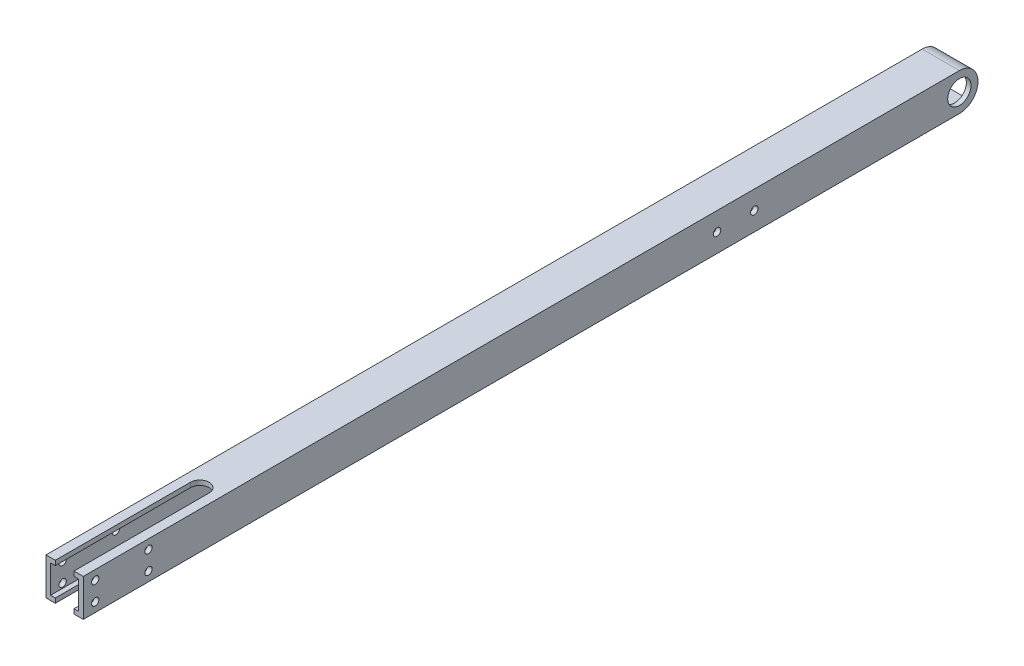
ISO-10303-21;
HEADER;
FILE_DESCRIPTION(('STEP AP214'),'2;1');
FILE_NAME('part.step','',(''),(''),'','','');
FILE_SCHEMA(('AUTOMOTIVE_DESIGN { 1 0 10303 214 1 1 1 1 }'));
ENDSEC;
DATA;
#1=APPLICATION_CONTEXT('core data for automotive mechanical design processes');
#2=APPLICATION_PROTOCOL_DEFINITION('international standard','automotive_design',2000,#1);
#3=PRODUCT_CONTEXT('',#1,'mechanical');
#4=PRODUCT('Part','Part','',(#3));
#5=PRODUCT_RELATED_PRODUCT_CATEGORY('part','',(#4));
#6=PRODUCT_DEFINITION_FORMATION('','',#4);
#7=PRODUCT_DEFINITION_CONTEXT('part definition',#1,'design');
#8=PRODUCT_DEFINITION('design','',#6,#7);
#9=PRODUCT_DEFINITION_SHAPE('','',#8);
#10=(LENGTH_UNIT() NAMED_UNIT(*) SI_UNIT(.MILLI.,.METRE.));
#11=(NAMED_UNIT(*) PLANE_ANGLE_UNIT() SI_UNIT($,.RADIAN.));
#12=(NAMED_UNIT(*) SI_UNIT($,.STERADIAN.) SOLID_ANGLE_UNIT());
#13=UNCERTAINTY_MEASURE_WITH_UNIT(LENGTH_MEASURE(1.E-05),#10,'distance_accuracy_value','');
#14=(GEOMETRIC_REPRESENTATION_CONTEXT(3) GLOBAL_UNCERTAINTY_ASSIGNED_CONTEXT((#13)) GLOBAL_UNIT_ASSIGNED_CONTEXT((#10,
#11,#12)) REPRESENTATION_CONTEXT('',''));
#15=CARTESIAN_POINT('',(0.,0.,0.));
#16=DIRECTION('',(0.,0.,1.));
#17=DIRECTION('',(1.,0.,0.));
#18=AXIS2_PLACEMENT_3D('',#15,#16,#17);
#19=CARTESIAN_POINT('',(0.,0.,609.6));
#20=DIRECTION('',(0.,0.,-1.));
#21=DIRECTION('',(-1.,0.,0.));
#22=AXIS2_PLACEMENT_3D('',#19,#20,#21);
#23=PLANE('',#22);
#24=DIRECTION('',(0.,-1.,0.));
#25=VECTOR('',#24,1.);
#26=CARTESIAN_POINT('',(6.34999999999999,-9.525,609.6));
#27=LINE('',#26,#25);
#28=CARTESIAN_POINT('',(6.34999999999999,-9.525,609.6));
#29=VERTEX_POINT('',#28);
#30=CARTESIAN_POINT('',(6.34999999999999,-12.7,609.6));
#31=VERTEX_POINT('',#30);
#32=EDGE_CURVE('E196',#29,#31,#27,.T.);
#33=ORIENTED_EDGE('',*,*,#32,.T.);
#34=DIRECTION('',(1.,0.,0.));
#35=VECTOR('',#34,1.);
#36=CARTESIAN_POINT('',(-12.7,-12.7,609.6));
#37=LINE('',#36,#35);
#38=CARTESIAN_POINT('',(12.7,-12.7,609.6));
#39=VERTEX_POINT('',#38);
#40=EDGE_CURVE('E251',#31,#39,#37,.T.);
#41=ORIENTED_EDGE('',*,*,#40,.T.);
#42=DIRECTION('',(0.,1.,0.));
#43=VECTOR('',#42,1.);
#44=CARTESIAN_POINT('',(12.7,-12.7,609.6));
#45=LINE('',#44,#43);
#46=CARTESIAN_POINT('',(12.7,12.7,609.6));
#47=VERTEX_POINT('',#46);
#48=EDGE_CURVE('E242',#39,#47,#45,.T.);
#49=ORIENTED_EDGE('',*,*,#48,.T.);
#50=DIRECTION('',(-1.,0.,0.));
#51=VECTOR('',#50,1.);
#52=CARTESIAN_POINT('',(-12.7,12.7,609.6));
#53=LINE('',#52,#51);
#54=CARTESIAN_POINT('',(6.35,12.7,609.6));
#55=VERTEX_POINT('',#54);
#56=EDGE_CURVE('E246',#47,#55,#53,.T.);
#57=ORIENTED_EDGE('',*,*,#56,.T.);
#58=DIRECTION('',(0.,1.,0.));
#59=VECTOR('',#58,1.);
#60=CARTESIAN_POINT('',(6.35,-12.701,609.6));
#61=LINE('',#60,#59);
#62=CARTESIAN_POINT('',(6.35,9.52499999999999,609.6));
#63=VERTEX_POINT('',#62);
#64=EDGE_CURVE('E381',#63,#55,#61,.T.);
#65=ORIENTED_EDGE('',*,*,#64,.F.);
#66=DIRECTION('',(-1.,0.,0.));
#67=VECTOR('',#66,1.);
#68=CARTESIAN_POINT('',(-9.525,9.525,609.6));
#69=LINE('',#68,#67);
#70=CARTESIAN_POINT('',(9.525,9.525,609.6));
#71=VERTEX_POINT('',#70);
#72=EDGE_CURVE('E228',#71,#63,#69,.T.);
#73=ORIENTED_EDGE('',*,*,#72,.F.);
#74=DIRECTION('',(0.,1.,0.));
#75=VECTOR('',#74,1.);
#76=CARTESIAN_POINT('',(9.525,-9.525,609.6));
#77=LINE('',#76,#75);
#78=CARTESIAN_POINT('',(9.525,-9.525,609.6));
#79=VERTEX_POINT('',#78);
#80=EDGE_CURVE('E217',#79,#71,#77,.T.);
#81=ORIENTED_EDGE('',*,*,#80,.F.);
#82=DIRECTION('',(1.,0.,0.));
#83=VECTOR('',#82,1.);
#84=CARTESIAN_POINT('',(-9.525,-9.525,609.6));
#85=LINE('',#84,#83);
#86=EDGE_CURVE('E210',#29,#79,#85,.T.);
#87=ORIENTED_EDGE('',*,*,#86,.F.);
#88=EDGE_LOOP('',(#33,#41,#49,#57,#65,#73,#81,#87));
#89=FACE_BOUND('',#88,.T.);
#90=ADVANCED_FACE('F77',(#89),#23,.F.);
#91=CARTESIAN_POINT('',(-12.7,-12.7,609.6));
#92=DIRECTION('',(0.,1.,0.));
#93=DIRECTION('',(0.,0.,1.));
#94=AXIS2_PLACEMENT_3D('',#91,#92,#93);
#95=PLANE('',#94);
#96=DIRECTION('',(0.,0.,-1.));
#97=VECTOR('',#96,1.);
#98=CARTESIAN_POINT('',(6.35000000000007,-12.7,0.));
#99=LINE('',#98,#97);
#100=CARTESIAN_POINT('',(6.35,-12.7,527.05));
#101=VERTEX_POINT('',#100);
#102=EDGE_CURVE('E201',#31,#101,#99,.T.);
#103=ORIENTED_EDGE('',*,*,#102,.T.);
#104=CARTESIAN_POINT('',(0.,-12.7,527.05));
#105=DIRECTION('',(0.,1.,0.));
#106=DIRECTION('',(0.,0.,1.));
#107=AXIS2_PLACEMENT_3D('',#104,#105,#106);
#108=CIRCLE('',#107,6.35);
#109=CARTESIAN_POINT('',(0.,-12.7,520.7));
#110=VERTEX_POINT('',#109);
#111=EDGE_CURVE('E86',#101,#110,#108,.T.);
#112=ORIENTED_EDGE('',*,*,#111,.T.);
#113=CARTESIAN_POINT('',(0.,-12.7,527.05));
#114=DIRECTION('',(0.,1.,0.));
#115=DIRECTION('',(0.,0.,1.));
#116=AXIS2_PLACEMENT_3D('',#113,#114,#115);
#117=CIRCLE('',#116,6.35);
#118=CARTESIAN_POINT('',(-6.35,-12.7,527.05));
#119=VERTEX_POINT('',#118);
#120=EDGE_CURVE('E311',#110,#119,#117,.T.);
#121=ORIENTED_EDGE('',*,*,#120,.T.);
#122=DIRECTION('',(0.,0.,-1.));
#123=VECTOR('',#122,1.);
#124=CARTESIAN_POINT('',(-6.34999999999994,-12.7,0.));
#125=LINE('',#124,#123);
#126=CARTESIAN_POINT('',(-6.35000000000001,-12.7,609.6));
#127=VERTEX_POINT('',#126);
#128=EDGE_CURVE('E212',#127,#119,#125,.T.);
#129=ORIENTED_EDGE('',*,*,#128,.F.);
#130=CARTESIAN_POINT('',(-12.7,-12.7,609.6));
#131=VERTEX_POINT('',#130);
#132=EDGE_CURVE('E252',#131,#127,#37,.T.);
#133=ORIENTED_EDGE('',*,*,#132,.F.);
#134=DIRECTION('',(0.,0.,-1.));
#135=VECTOR('',#134,1.);
#136=CARTESIAN_POINT('',(-12.7,-12.7,609.6));
#137=LINE('',#136,#135);
#138=CARTESIAN_POINT('',(-12.7,-12.7,12.7000000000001));
#139=VERTEX_POINT('',#138);
#140=EDGE_CURVE('E258',#131,#139,#137,.T.);
#141=ORIENTED_EDGE('',*,*,#140,.T.);
#142=DIRECTION('',(1.,0.,0.));
#143=VECTOR('',#142,1.);
#144=CARTESIAN_POINT('',(-12.7,-12.7,12.7000000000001));
#145=LINE('',#144,#143);
#146=CARTESIAN_POINT('',(12.7,-12.7,12.7000000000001));
#147=VERTEX_POINT('',#146);
#148=EDGE_CURVE('E407',#139,#147,#145,.T.);
#149=ORIENTED_EDGE('',*,*,#148,.T.);
#150=DIRECTION('',(0.,0.,-1.));
#151=VECTOR('',#150,1.);
#152=CARTESIAN_POINT('',(12.7,-12.7,609.6));
#153=LINE('',#152,#151);
#154=EDGE_CURVE('E255',#39,#147,#153,.T.);
#155=ORIENTED_EDGE('',*,*,#154,.F.);
#156=ORIENTED_EDGE('',*,*,#40,.F.);
#157=EDGE_LOOP('',(#103,#112,#121,#129,#133,#141,#149,#155,#156));
#158=FACE_BOUND('',#157,.T.);
#159=ADVANCED_FACE('F317',(#158),#95,.F.);
#160=CARTESIAN_POINT('',(-9.525,-9.525,609.6));
#161=DIRECTION('',(0.,1.,0.));
#162=DIRECTION('',(0.,0.,1.));
#163=AXIS2_PLACEMENT_3D('',#160,#161,#162);
#164=PLANE('',#163);
#165=CARTESIAN_POINT('',(0.,-9.525,527.05));
#166=DIRECTION('',(0.,1.,0.));
#167=DIRECTION('',(0.,0.,1.));
#168=AXIS2_PLACEMENT_3D('',#165,#166,#167);
#169=CIRCLE('',#168,6.35);
#170=CARTESIAN_POINT('',(-6.35,-9.525,527.05));
#171=VERTEX_POINT('',#170);
#172=CARTESIAN_POINT('',(0.,-9.525,520.7));
#173=VERTEX_POINT('',#172);
#174=EDGE_CURVE('E92',#171,#173,#169,.F.);
#175=ORIENTED_EDGE('',*,*,#174,.T.);
#176=CARTESIAN_POINT('',(0.,-9.525,527.05));
#177=DIRECTION('',(0.,1.,0.));
#178=DIRECTION('',(0.,0.,1.));
#179=AXIS2_PLACEMENT_3D('',#176,#177,#178);
#180=CIRCLE('',#179,6.35);
#181=CARTESIAN_POINT('',(6.35,-9.525,527.05));
#182=VERTEX_POINT('',#181);
#183=EDGE_CURVE('E12',#173,#182,#180,.F.);
#184=ORIENTED_EDGE('',*,*,#183,.T.);
#185=DIRECTION('',(0.,0.,-1.));
#186=VECTOR('',#185,1.);
#187=CARTESIAN_POINT('',(6.35000000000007,-9.525,0.));
#188=LINE('',#187,#186);
#189=EDGE_CURVE('E199',#29,#182,#188,.T.);
#190=ORIENTED_EDGE('',*,*,#189,.F.);
#191=ORIENTED_EDGE('',*,*,#86,.T.);
#192=DIRECTION('',(0.,0.,-1.));
#193=VECTOR('',#192,1.);
#194=CARTESIAN_POINT('',(9.525,-9.525,609.6));
#195=LINE('',#194,#193);
#196=CARTESIAN_POINT('',(9.525,-9.52499999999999,4.29973958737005));
#197=VERTEX_POINT('',#196);
#198=EDGE_CURVE('E237',#79,#197,#195,.T.);
#199=ORIENTED_EDGE('',*,*,#198,.T.);
#200=DIRECTION('',(1.,0.,0.));
#201=VECTOR('',#200,1.);
#202=CARTESIAN_POINT('',(-12.7,-9.52499999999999,4.29973958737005));
#203=LINE('',#202,#201);
#204=CARTESIAN_POINT('',(-9.525,-9.52499999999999,4.29973958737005));
#205=VERTEX_POINT('',#204);
#206=EDGE_CURVE('E411',#205,#197,#203,.T.);
#207=ORIENTED_EDGE('',*,*,#206,.F.);
#208=DIRECTION('',(0.,0.,-1.));
#209=VECTOR('',#208,1.);
#210=CARTESIAN_POINT('',(-9.525,-9.525,609.6));
#211=LINE('',#210,#209);
#212=CARTESIAN_POINT('',(-9.525,-9.525,609.6));
#213=VERTEX_POINT('',#212);
#214=EDGE_CURVE('E239',#213,#205,#211,.T.);
#215=ORIENTED_EDGE('',*,*,#214,.F.);
#216=CARTESIAN_POINT('',(-6.35000000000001,-9.525,609.6));
#217=VERTEX_POINT('',#216);
#218=EDGE_CURVE('E218',#213,#217,#85,.T.);
#219=ORIENTED_EDGE('',*,*,#218,.T.);
#220=DIRECTION('',(0.,0.,-1.));
#221=VECTOR('',#220,1.);
#222=CARTESIAN_POINT('',(-6.34999999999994,-9.525,0.));
#223=LINE('',#222,#221);
#224=EDGE_CURVE('E206',#217,#171,#223,.T.);
#225=ORIENTED_EDGE('',*,*,#224,.T.);
#226=EDGE_LOOP('',(#175,#184,#190,#191,#199,#207,#215,#219,#225));
#227=FACE_BOUND('',#226,.T.);
#228=ADVANCED_FACE('F208',(#227),#164,.T.);
#229=ORIENTED_EDGE('',*,*,#132,.T.);
#230=DIRECTION('',(0.,-1.,0.));
#231=VECTOR('',#230,1.);
#232=CARTESIAN_POINT('',(-6.35000000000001,-9.525,609.6));
#233=LINE('',#232,#231);
#234=EDGE_CURVE('E205',#217,#127,#233,.T.);
#235=ORIENTED_EDGE('',*,*,#234,.F.);
#236=ORIENTED_EDGE('',*,*,#218,.F.);
#237=DIRECTION('',(0.,-1.,0.));
#238=VECTOR('',#237,1.);
#239=CARTESIAN_POINT('',(-9.525,-9.525,609.6));
#240=LINE('',#239,#238);
#241=CARTESIAN_POINT('',(-9.525,9.525,609.6));
#242=VERTEX_POINT('',#241);
#243=EDGE_CURVE('E219',#242,#213,#240,.T.);
#244=ORIENTED_EDGE('',*,*,#243,.F.);
#245=CARTESIAN_POINT('',(-6.34999999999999,9.52499999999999,609.6));
#246=VERTEX_POINT('',#245);
#247=EDGE_CURVE('E227',#246,#242,#69,.T.);
#248=ORIENTED_EDGE('',*,*,#247,.F.);
#249=DIRECTION('',(0.,1.,0.));
#250=VECTOR('',#249,1.);
#251=CARTESIAN_POINT('',(-6.34999999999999,-12.701,609.6));
#252=LINE('',#251,#250);
#253=CARTESIAN_POINT('',(-6.34999999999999,12.7,609.6));
#254=VERTEX_POINT('',#253);
#255=EDGE_CURVE('E382',#246,#254,#252,.T.);
#256=ORIENTED_EDGE('',*,*,#255,.T.);
#257=CARTESIAN_POINT('',(-12.7,12.7,609.6));
#258=VERTEX_POINT('',#257);
#259=EDGE_CURVE('E245',#254,#258,#53,.T.);
#260=ORIENTED_EDGE('',*,*,#259,.T.);
#261=DIRECTION('',(0.,-1.,0.));
#262=VECTOR('',#261,1.);
#263=CARTESIAN_POINT('',(-12.7,-12.7,609.6));
#264=LINE('',#263,#262);
#265=EDGE_CURVE('E249',#258,#131,#264,.T.);
#266=ORIENTED_EDGE('',*,*,#265,.T.);
#267=EDGE_LOOP('',(#229,#235,#236,#244,#248,#256,#260,#266));
#268=FACE_BOUND('',#267,.T.);
#269=ADVANCED_FACE('F447',(#268),#23,.F.);
#270=CARTESIAN_POINT('',(-12.7,12.7,609.6));
#271=DIRECTION('',(0.,-1.,0.));
#272=DIRECTION('',(0.,0.,-1.));
#273=AXIS2_PLACEMENT_3D('',#270,#271,#272);
#274=PLANE('',#273);
#275=DIRECTION('',(0.,0.,-1.));
#276=VECTOR('',#275,1.);
#277=CARTESIAN_POINT('',(-6.35000000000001,12.7,0.));
#278=LINE('',#277,#276);
#279=CARTESIAN_POINT('',(-6.35,12.7,517.525));
#280=VERTEX_POINT('',#279);
#281=EDGE_CURVE('E378',#254,#280,#278,.T.);
#282=ORIENTED_EDGE('',*,*,#281,.T.);
#283=CARTESIAN_POINT('',(0.,12.7,517.525));
#284=DIRECTION('',(0.,1.,0.));
#285=DIRECTION('',(0.,0.,1.));
#286=AXIS2_PLACEMENT_3D('',#283,#284,#285);
#287=CIRCLE('',#286,6.35);
#288=CARTESIAN_POINT('',(6.35,12.7,517.525));
#289=VERTEX_POINT('',#288);
#290=EDGE_CURVE('E383',#280,#289,#287,.F.);
#291=ORIENTED_EDGE('',*,*,#290,.T.);
#292=DIRECTION('',(0.,0.,-1.));
#293=VECTOR('',#292,1.);
#294=CARTESIAN_POINT('',(6.35,12.7,0.));
#295=LINE('',#294,#293);
#296=EDGE_CURVE('E377',#55,#289,#295,.T.);
#297=ORIENTED_EDGE('',*,*,#296,.F.);
#298=ORIENTED_EDGE('',*,*,#56,.F.);
#299=DIRECTION('',(0.,0.,-1.));
#300=VECTOR('',#299,1.);
#301=CARTESIAN_POINT('',(12.7,12.7,609.6));
#302=LINE('',#301,#300);
#303=CARTESIAN_POINT('',(12.7,12.7,12.7000000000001));
#304=VERTEX_POINT('',#303);
#305=EDGE_CURVE('E264',#47,#304,#302,.T.);
#306=ORIENTED_EDGE('',*,*,#305,.T.);
#307=DIRECTION('',(1.,0.,0.));
#308=VECTOR('',#307,1.);
#309=CARTESIAN_POINT('',(-12.7,12.7,12.7000000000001));
#310=LINE('',#309,#308);
#311=CARTESIAN_POINT('',(-12.7,12.7,12.7000000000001));
#312=VERTEX_POINT('',#311);
#313=EDGE_CURVE('E400',#312,#304,#310,.T.);
#314=ORIENTED_EDGE('',*,*,#313,.F.);
#315=DIRECTION('',(0.,0.,-1.));
#316=VECTOR('',#315,1.);
#317=CARTESIAN_POINT('',(-12.7,12.7,609.6));
#318=LINE('',#317,#316);
#319=EDGE_CURVE('E261',#258,#312,#318,.T.);
#320=ORIENTED_EDGE('',*,*,#319,.F.);
#321=ORIENTED_EDGE('',*,*,#259,.F.);
#322=EDGE_LOOP('',(#282,#291,#297,#298,#306,#314,#320,#321));
#323=FACE_BOUND('',#322,.T.);
#324=ADVANCED_FACE('F457',(#323),#274,.F.);
#325=CARTESIAN_POINT('',(-9.525,9.525,609.6));
#326=DIRECTION('',(0.,-1.,0.));
#327=DIRECTION('',(0.,0.,-1.));
#328=AXIS2_PLACEMENT_3D('',#325,#326,#327);
#329=PLANE('',#328);
#330=CARTESIAN_POINT('',(0.,9.525,517.525));
#331=DIRECTION('',(0.,-1.,0.));
#332=DIRECTION('',(0.,0.,-1.));
#333=AXIS2_PLACEMENT_3D('',#330,#331,#332);
#334=CIRCLE('',#333,6.35);
#335=CARTESIAN_POINT('',(-6.35,9.52499999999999,517.525));
#336=VERTEX_POINT('',#335);
#337=CARTESIAN_POINT('',(6.35,9.525,517.525));
#338=VERTEX_POINT('',#337);
#339=EDGE_CURVE('E375',#336,#338,#334,.T.);
#340=ORIENTED_EDGE('',*,*,#339,.F.);
#341=DIRECTION('',(0.,0.,-1.));
#342=VECTOR('',#341,1.);
#343=CARTESIAN_POINT('',(-6.35000000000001,9.525,0.));
#344=LINE('',#343,#342);
#345=EDGE_CURVE('E374',#246,#336,#344,.T.);
#346=ORIENTED_EDGE('',*,*,#345,.F.);
#347=ORIENTED_EDGE('',*,*,#247,.T.);
#348=DIRECTION('',(0.,0.,-1.));
#349=VECTOR('',#348,1.);
#350=CARTESIAN_POINT('',(-9.525,9.525,609.6));
#351=LINE('',#350,#349);
#352=CARTESIAN_POINT('',(-9.525,9.525,4.29973958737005));
#353=VERTEX_POINT('',#352);
#354=EDGE_CURVE('E231',#242,#353,#351,.T.);
#355=ORIENTED_EDGE('',*,*,#354,.T.);
#356=DIRECTION('',(1.,0.,0.));
#357=VECTOR('',#356,1.);
#358=CARTESIAN_POINT('',(-12.7,9.525,4.29973958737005));
#359=LINE('',#358,#357);
#360=CARTESIAN_POINT('',(9.525,9.525,4.29973958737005));
#361=VERTEX_POINT('',#360);
#362=EDGE_CURVE('E273',#361,#353,#359,.F.);
#363=ORIENTED_EDGE('',*,*,#362,.F.);
#364=DIRECTION('',(0.,0.,-1.));
#365=VECTOR('',#364,1.);
#366=CARTESIAN_POINT('',(9.525,9.525,609.6));
#367=LINE('',#366,#365);
#368=EDGE_CURVE('E234',#71,#361,#367,.T.);
#369=ORIENTED_EDGE('',*,*,#368,.F.);
#370=ORIENTED_EDGE('',*,*,#72,.T.);
#371=DIRECTION('',(0.,0.,-1.));
#372=VECTOR('',#371,1.);
#373=CARTESIAN_POINT('',(6.35,9.525,0.));
#374=LINE('',#373,#372);
#375=EDGE_CURVE('E389',#63,#338,#374,.T.);
#376=ORIENTED_EDGE('',*,*,#375,.T.);
#377=EDGE_LOOP('',(#340,#346,#347,#355,#363,#369,#370,#376));
#378=FACE_BOUND('',#377,.T.);
#379=ADVANCED_FACE('F443',(#378),#329,.T.);
#380=CARTESIAN_POINT('',(12.7,-12.7,609.6));
#381=DIRECTION('',(-1.,0.,0.));
#382=DIRECTION('',(0.,0.,1.));
#383=AXIS2_PLACEMENT_3D('',#380,#381,#382);
#384=PLANE('',#383);
#385=CARTESIAN_POINT('',(12.7,-6.34999999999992,601.435714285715));
#386=DIRECTION('',(-1.,0.,0.));
#387=DIRECTION('',(0.,0.,1.));
#388=AXIS2_PLACEMENT_3D('',#385,#386,#387);
#389=CIRCLE('',#388,2.48919999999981);
#390=CARTESIAN_POINT('',(12.7,-6.34999999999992,603.924914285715));
#391=VERTEX_POINT('',#390);
#392=EDGE_CURVE('E306',#391,#391,#389,.T.);
#393=ORIENTED_EDGE('',*,*,#392,.T.);
#394=EDGE_LOOP('',(#393));
#395=FACE_BOUND('',#394,.T.);
#396=CARTESIAN_POINT('',(12.7,6.35000000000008,601.435714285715));
#397=DIRECTION('',(-1.,0.,0.));
#398=DIRECTION('',(0.,0.,1.));
#399=AXIS2_PLACEMENT_3D('',#396,#397,#398);
#400=CIRCLE('',#399,2.48919999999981);
#401=CARTESIAN_POINT('',(12.7,6.35000000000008,603.924914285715));
#402=VERTEX_POINT('',#401);
#403=EDGE_CURVE('E301',#402,#402,#400,.T.);
#404=ORIENTED_EDGE('',*,*,#403,.T.);
#405=EDGE_LOOP('',(#404));
#406=FACE_BOUND('',#405,.T.);
#407=CARTESIAN_POINT('',(12.7,-6.34999999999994,565.15));
#408=DIRECTION('',(-1.,0.,0.));
#409=DIRECTION('',(0.,0.,1.));
#410=AXIS2_PLACEMENT_3D('',#407,#408,#409);
#411=CIRCLE('',#410,2.48919999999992);
#412=CARTESIAN_POINT('',(12.7,-6.34999999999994,567.6392));
#413=VERTEX_POINT('',#412);
#414=EDGE_CURVE('E296',#413,#413,#411,.T.);
#415=ORIENTED_EDGE('',*,*,#414,.T.);
#416=EDGE_LOOP('',(#415));
#417=FACE_BOUND('',#416,.T.);
#418=CARTESIAN_POINT('',(12.7,6.35000000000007,565.15));
#419=DIRECTION('',(-1.,0.,0.));
#420=DIRECTION('',(0.,0.,1.));
#421=AXIS2_PLACEMENT_3D('',#418,#419,#420);
#422=CIRCLE('',#421,2.48919999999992);
#423=CARTESIAN_POINT('',(12.7,6.35000000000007,567.6392));
#424=VERTEX_POINT('',#423);
#425=EDGE_CURVE('E291',#424,#424,#422,.T.);
#426=ORIENTED_EDGE('',*,*,#425,.T.);
#427=EDGE_LOOP('',(#426));
#428=FACE_BOUND('',#427,.T.);
#429=CARTESIAN_POINT('',(12.7,0.,152.4));
#430=DIRECTION('',(1.,0.,0.));
#431=DIRECTION('',(0.,0.,-1.));
#432=AXIS2_PLACEMENT_3D('',#429,#430,#431);
#433=CIRCLE('',#432,2.55270000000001);
#434=CARTESIAN_POINT('',(12.7,0.,149.8473));
#435=VERTEX_POINT('',#434);
#436=EDGE_CURVE('E360',#435,#435,#433,.T.);
#437=ORIENTED_EDGE('',*,*,#436,.F.);
#438=EDGE_LOOP('',(#437));
#439=FACE_BOUND('',#438,.T.);
#440=CARTESIAN_POINT('',(12.7,0.,177.8));
#441=DIRECTION('',(1.,0.,0.));
#442=DIRECTION('',(0.,0.,-1.));
#443=AXIS2_PLACEMENT_3D('',#440,#441,#442);
#444=CIRCLE('',#443,2.55269999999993);
#445=CARTESIAN_POINT('',(12.7,0.,175.2473));
#446=VERTEX_POINT('',#445);
#447=EDGE_CURVE('E367',#446,#446,#444,.T.);
#448=ORIENTED_EDGE('',*,*,#447,.F.);
#449=EDGE_LOOP('',(#448));
#450=FACE_BOUND('',#449,.T.);
#451=CARTESIAN_POINT('',(12.7,0.,12.7));
#452=DIRECTION('',(1.,0.,0.));
#453=DIRECTION('',(0.,0.,-1.));
#454=AXIS2_PLACEMENT_3D('',#451,#452,#453);
#455=CIRCLE('',#454,7.9375);
#456=CARTESIAN_POINT('',(12.7,0.,4.7625));
#457=VERTEX_POINT('',#456);
#458=EDGE_CURVE('E415',#457,#457,#455,.T.);
#459=ORIENTED_EDGE('',*,*,#458,.F.);
#460=EDGE_LOOP('',(#459));
#461=FACE_BOUND('',#460,.T.);
#462=CARTESIAN_POINT('',(12.7,0.,12.7000000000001));
#463=DIRECTION('',(1.,0.,0.));
#464=DIRECTION('',(0.,0.,-1.));
#465=AXIS2_PLACEMENT_3D('',#462,#463,#464);
#466=CIRCLE('',#465,12.7);
#467=EDGE_CURVE('E403',#304,#147,#466,.F.);
#468=ORIENTED_EDGE('',*,*,#467,.F.);
#469=ORIENTED_EDGE('',*,*,#305,.F.);
#470=ORIENTED_EDGE('',*,*,#48,.F.);
#471=ORIENTED_EDGE('',*,*,#154,.T.);
#472=EDGE_LOOP('',(#468,#469,#470,#471));
#473=FACE_BOUND('',#472,.T.);
#474=ADVANCED_FACE('F494',(#395,#406,#417,#428,#439,#450,#461,#473),#384,.F.);
#475=CARTESIAN_POINT('',(-12.7,-12.7,609.6));
#476=DIRECTION('',(1.,0.,0.));
#477=DIRECTION('',(0.,0.,-1.));
#478=AXIS2_PLACEMENT_3D('',#475,#476,#477);
#479=PLANE('',#478);
#480=CARTESIAN_POINT('',(-12.7,-6.34999999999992,601.435714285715));
#481=DIRECTION('',(-1.,0.,0.));
#482=DIRECTION('',(0.,0.,1.));
#483=AXIS2_PLACEMENT_3D('',#480,#481,#482);
#484=CIRCLE('',#483,2.48919999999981);
#485=CARTESIAN_POINT('',(-12.7,-6.34999999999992,603.924914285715));
#486=VERTEX_POINT('',#485);
#487=EDGE_CURVE('E331',#486,#486,#484,.T.);
#488=ORIENTED_EDGE('',*,*,#487,.F.);
#489=EDGE_LOOP('',(#488));
#490=FACE_BOUND('',#489,.T.);
#491=CARTESIAN_POINT('',(-12.7,6.35000000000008,601.435714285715));
#492=DIRECTION('',(-1.,0.,0.));
#493=DIRECTION('',(0.,0.,1.));
#494=AXIS2_PLACEMENT_3D('',#491,#492,#493);
#495=CIRCLE('',#494,2.48919999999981);
#496=CARTESIAN_POINT('',(-12.7,6.35000000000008,603.924914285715));
#497=VERTEX_POINT('',#496);
#498=EDGE_CURVE('E339',#497,#497,#495,.T.);
#499=ORIENTED_EDGE('',*,*,#498,.F.);
#500=EDGE_LOOP('',(#499));
#501=FACE_BOUND('',#500,.T.);
#502=CARTESIAN_POINT('',(-12.7,-6.34999999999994,565.15));
#503=DIRECTION('',(-1.,0.,0.));
#504=DIRECTION('',(0.,0.,1.));
#505=AXIS2_PLACEMENT_3D('',#502,#503,#504);
#506=CIRCLE('',#505,2.48919999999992);
#507=CARTESIAN_POINT('',(-12.7,-6.34999999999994,567.6392));
#508=VERTEX_POINT('',#507);
#509=EDGE_CURVE('E346',#508,#508,#506,.T.);
#510=ORIENTED_EDGE('',*,*,#509,.F.);
#511=EDGE_LOOP('',(#510));
#512=FACE_BOUND('',#511,.T.);
#513=CARTESIAN_POINT('',(-12.7,6.35000000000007,565.15));
#514=DIRECTION('',(-1.,0.,0.));
#515=DIRECTION('',(0.,0.,1.));
#516=AXIS2_PLACEMENT_3D('',#513,#514,#515);
#517=CIRCLE('',#516,2.48919999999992);
#518=CARTESIAN_POINT('',(-12.7,6.35000000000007,567.6392));
#519=VERTEX_POINT('',#518);
#520=EDGE_CURVE('E353',#519,#519,#517,.T.);
#521=ORIENTED_EDGE('',*,*,#520,.F.);
#522=EDGE_LOOP('',(#521));
#523=FACE_BOUND('',#522,.T.);
#524=CARTESIAN_POINT('',(-12.7,0.,152.4));
#525=DIRECTION('',(1.,0.,0.));
#526=DIRECTION('',(0.,0.,-1.));
#527=AXIS2_PLACEMENT_3D('',#524,#525,#526);
#528=CIRCLE('',#527,2.55270000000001);
#529=CARTESIAN_POINT('',(-12.7,0.,149.8473));
#530=VERTEX_POINT('',#529);
#531=EDGE_CURVE('E286',#530,#530,#528,.T.);
#532=ORIENTED_EDGE('',*,*,#531,.T.);
#533=EDGE_LOOP('',(#532));
#534=FACE_BOUND('',#533,.T.);
#535=CARTESIAN_POINT('',(-12.7,0.,177.8));
#536=DIRECTION('',(1.,0.,0.));
#537=DIRECTION('',(0.,0.,-1.));
#538=AXIS2_PLACEMENT_3D('',#535,#536,#537);
#539=CIRCLE('',#538,2.55269999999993);
#540=CARTESIAN_POINT('',(-12.7,0.,175.2473));
#541=VERTEX_POINT('',#540);
#542=EDGE_CURVE('E281',#541,#541,#539,.T.);
#543=ORIENTED_EDGE('',*,*,#542,.T.);
#544=EDGE_LOOP('',(#543));
#545=FACE_BOUND('',#544,.T.);
#546=CARTESIAN_POINT('',(-12.7,0.,12.7));
#547=DIRECTION('',(1.,0.,0.));
#548=DIRECTION('',(0.,0.,-1.));
#549=AXIS2_PLACEMENT_3D('',#546,#547,#548);
#550=CIRCLE('',#549,7.9375);
#551=CARTESIAN_POINT('',(-12.7,0.,4.7625));
#552=VERTEX_POINT('',#551);
#553=EDGE_CURVE('E271',#552,#552,#550,.T.);
#554=ORIENTED_EDGE('',*,*,#553,.T.);
#555=EDGE_LOOP('',(#554));
#556=FACE_BOUND('',#555,.T.);
#557=ORIENTED_EDGE('',*,*,#319,.T.);
#558=CARTESIAN_POINT('',(-12.7,0.,12.7000000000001));
#559=DIRECTION('',(1.,0.,0.));
#560=DIRECTION('',(0.,0.,-1.));
#561=AXIS2_PLACEMENT_3D('',#558,#559,#560);
#562=CIRCLE('',#561,12.7);
#563=EDGE_CURVE('E404',#312,#139,#562,.F.);
#564=ORIENTED_EDGE('',*,*,#563,.T.);
#565=ORIENTED_EDGE('',*,*,#140,.F.);
#566=ORIENTED_EDGE('',*,*,#265,.F.);
#567=EDGE_LOOP('',(#557,#564,#565,#566));
#568=FACE_BOUND('',#567,.T.);
#569=ADVANCED_FACE('F429',(#490,#501,#512,#523,#534,#545,#556,#568),#479,.F.);
#570=CARTESIAN_POINT('',(-9.525,-9.525,609.6));
#571=DIRECTION('',(1.,0.,0.));
#572=DIRECTION('',(0.,0.,-1.));
#573=AXIS2_PLACEMENT_3D('',#570,#571,#572);
#574=PLANE('',#573);
#575=CARTESIAN_POINT('',(-9.525,-6.34999999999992,601.435714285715));
#576=DIRECTION('',(1.,0.,0.));
#577=DIRECTION('',(0.,0.,-1.));
#578=AXIS2_PLACEMENT_3D('',#575,#576,#577);
#579=CIRCLE('',#578,2.48919999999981);
#580=CARTESIAN_POINT('',(-9.525,-6.34999999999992,598.946514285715));
#581=VERTEX_POINT('',#580);
#582=EDGE_CURVE('E305',#581,#581,#579,.T.);
#583=ORIENTED_EDGE('',*,*,#582,.F.);
#584=EDGE_LOOP('',(#583));
#585=FACE_BOUND('',#584,.T.);
#586=CARTESIAN_POINT('',(-9.525,6.35000000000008,601.435714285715));
#587=DIRECTION('',(1.,0.,0.));
#588=DIRECTION('',(0.,0.,-1.));
#589=AXIS2_PLACEMENT_3D('',#586,#587,#588);
#590=CIRCLE('',#589,2.48919999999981);
#591=CARTESIAN_POINT('',(-9.525,6.35000000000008,598.946514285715));
#592=VERTEX_POINT('',#591);
#593=EDGE_CURVE('E300',#592,#592,#590,.T.);
#594=ORIENTED_EDGE('',*,*,#593,.F.);
#595=EDGE_LOOP('',(#594));
#596=FACE_BOUND('',#595,.T.);
#597=CARTESIAN_POINT('',(-9.525,-6.34999999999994,565.15));
#598=DIRECTION('',(1.,0.,0.));
#599=DIRECTION('',(0.,0.,-1.));
#600=AXIS2_PLACEMENT_3D('',#597,#598,#599);
#601=CIRCLE('',#600,2.48919999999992);
#602=CARTESIAN_POINT('',(-9.525,-6.34999999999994,562.6608));
#603=VERTEX_POINT('',#602);
#604=EDGE_CURVE('E295',#603,#603,#601,.T.);
#605=ORIENTED_EDGE('',*,*,#604,.F.);
#606=EDGE_LOOP('',(#605));
#607=FACE_BOUND('',#606,.T.);
#608=CARTESIAN_POINT('',(-9.525,6.35000000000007,565.15));
#609=DIRECTION('',(1.,0.,0.));
#610=DIRECTION('',(0.,0.,-1.));
#611=AXIS2_PLACEMENT_3D('',#608,#609,#610);
#612=CIRCLE('',#611,2.48919999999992);
#613=CARTESIAN_POINT('',(-9.525,6.35000000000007,562.6608));
#614=VERTEX_POINT('',#613);
#615=EDGE_CURVE('E290',#614,#614,#612,.T.);
#616=ORIENTED_EDGE('',*,*,#615,.F.);
#617=EDGE_LOOP('',(#616));
#618=FACE_BOUND('',#617,.T.);
#619=CARTESIAN_POINT('',(-9.525,0.,152.4));
#620=DIRECTION('',(1.,0.,0.));
#621=DIRECTION('',(0.,0.,-1.));
#622=AXIS2_PLACEMENT_3D('',#619,#620,#621);
#623=CIRCLE('',#622,2.55270000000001);
#624=CARTESIAN_POINT('',(-9.525,0.,149.8473));
#625=VERTEX_POINT('',#624);
#626=EDGE_CURVE('E285',#625,#625,#623,.T.);
#627=ORIENTED_EDGE('',*,*,#626,.F.);
#628=EDGE_LOOP('',(#627));
#629=FACE_BOUND('',#628,.T.);
#630=CARTESIAN_POINT('',(-9.525,0.,177.8));
#631=DIRECTION('',(1.,0.,0.));
#632=DIRECTION('',(0.,0.,-1.));
#633=AXIS2_PLACEMENT_3D('',#630,#631,#632);
#634=CIRCLE('',#633,2.55269999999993);
#635=CARTESIAN_POINT('',(-9.525,0.,175.2473));
#636=VERTEX_POINT('',#635);
#637=EDGE_CURVE('E280',#636,#636,#634,.T.);
#638=ORIENTED_EDGE('',*,*,#637,.F.);
#639=EDGE_LOOP('',(#638));
#640=FACE_BOUND('',#639,.T.);
#641=CARTESIAN_POINT('',(-9.525,0.,12.7));
#642=DIRECTION('',(1.,0.,0.));
#643=DIRECTION('',(0.,0.,-1.));
#644=AXIS2_PLACEMENT_3D('',#641,#642,#643);
#645=CIRCLE('',#644,7.9375);
#646=CARTESIAN_POINT('',(-9.525,0.,4.7625));
#647=VERTEX_POINT('',#646);
#648=EDGE_CURVE('E222',#647,#647,#645,.T.);
#649=ORIENTED_EDGE('',*,*,#648,.F.);
#650=EDGE_LOOP('',(#649));
#651=FACE_BOUND('',#650,.T.);
#652=CARTESIAN_POINT('',(-9.525,0.,12.7000000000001));
#653=DIRECTION('',(1.,0.,0.));
#654=DIRECTION('',(0.,0.,-1.));
#655=AXIS2_PLACEMENT_3D('',#652,#653,#654);
#656=CIRCLE('',#655,12.7);
#657=EDGE_CURVE('E413',#353,#205,#656,.F.);
#658=ORIENTED_EDGE('',*,*,#657,.F.);
#659=ORIENTED_EDGE('',*,*,#354,.F.);
#660=ORIENTED_EDGE('',*,*,#243,.T.);
#661=ORIENTED_EDGE('',*,*,#214,.T.);
#662=EDGE_LOOP('',(#658,#659,#660,#661));
#663=FACE_BOUND('',#662,.T.);
#664=ADVANCED_FACE('F425',(#585,#596,#607,#618,#629,#640,#651,#663),#574,.T.);
#665=CARTESIAN_POINT('',(9.525,-9.525,609.6));
#666=DIRECTION('',(-1.,0.,0.));
#667=DIRECTION('',(0.,0.,1.));
#668=AXIS2_PLACEMENT_3D('',#665,#666,#667);
#669=PLANE('',#668);
#670=CARTESIAN_POINT('',(9.525,-6.34999999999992,601.435714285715));
#671=DIRECTION('',(-1.,0.,0.));
#672=DIRECTION('',(0.,0.,1.));
#673=AXIS2_PLACEMENT_3D('',#670,#671,#672);
#674=CIRCLE('',#673,2.48919999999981);
#675=CARTESIAN_POINT('',(9.525,-6.34999999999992,603.924914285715));
#676=VERTEX_POINT('',#675);
#677=EDGE_CURVE('E302',#676,#676,#674,.T.);
#678=ORIENTED_EDGE('',*,*,#677,.F.);
#679=EDGE_LOOP('',(#678));
#680=FACE_BOUND('',#679,.T.);
#681=CARTESIAN_POINT('',(9.525,6.35000000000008,601.435714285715));
#682=DIRECTION('',(-1.,0.,0.));
#683=DIRECTION('',(0.,0.,1.));
#684=AXIS2_PLACEMENT_3D('',#681,#682,#683);
#685=CIRCLE('',#684,2.48919999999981);
#686=CARTESIAN_POINT('',(9.525,6.35000000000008,603.924914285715));
#687=VERTEX_POINT('',#686);
#688=EDGE_CURVE('E297',#687,#687,#685,.T.);
#689=ORIENTED_EDGE('',*,*,#688,.F.);
#690=EDGE_LOOP('',(#689));
#691=FACE_BOUND('',#690,.T.);
#692=CARTESIAN_POINT('',(9.525,-6.34999999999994,565.15));
#693=DIRECTION('',(-1.,0.,0.));
#694=DIRECTION('',(0.,0.,1.));
#695=AXIS2_PLACEMENT_3D('',#692,#693,#694);
#696=CIRCLE('',#695,2.48919999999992);
#697=CARTESIAN_POINT('',(9.525,-6.34999999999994,567.6392));
#698=VERTEX_POINT('',#697);
#699=EDGE_CURVE('E292',#698,#698,#696,.T.);
#700=ORIENTED_EDGE('',*,*,#699,.F.);
#701=EDGE_LOOP('',(#700));
#702=FACE_BOUND('',#701,.T.);
#703=CARTESIAN_POINT('',(9.525,6.35000000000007,565.15));
#704=DIRECTION('',(-1.,0.,0.));
#705=DIRECTION('',(0.,0.,1.));
#706=AXIS2_PLACEMENT_3D('',#703,#704,#705);
#707=CIRCLE('',#706,2.48919999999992);
#708=CARTESIAN_POINT('',(9.525,6.35000000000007,567.6392));
#709=VERTEX_POINT('',#708);
#710=EDGE_CURVE('E287',#709,#709,#707,.T.);
#711=ORIENTED_EDGE('',*,*,#710,.F.);
#712=EDGE_LOOP('',(#711));
#713=FACE_BOUND('',#712,.T.);
#714=CARTESIAN_POINT('',(9.525,0.,152.4));
#715=DIRECTION('',(-1.,0.,0.));
#716=DIRECTION('',(0.,0.,1.));
#717=AXIS2_PLACEMENT_3D('',#714,#715,#716);
#718=CIRCLE('',#717,2.55270000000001);
#719=CARTESIAN_POINT('',(9.525,0.,154.9527));
#720=VERTEX_POINT('',#719);
#721=EDGE_CURVE('E282',#720,#720,#718,.T.);
#722=ORIENTED_EDGE('',*,*,#721,.F.);
#723=EDGE_LOOP('',(#722));
#724=FACE_BOUND('',#723,.T.);
#725=CARTESIAN_POINT('',(9.525,0.,177.8));
#726=DIRECTION('',(-1.,0.,0.));
#727=DIRECTION('',(0.,0.,1.));
#728=AXIS2_PLACEMENT_3D('',#725,#726,#727);
#729=CIRCLE('',#728,2.55269999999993);
#730=CARTESIAN_POINT('',(9.525,0.,180.3527));
#731=VERTEX_POINT('',#730);
#732=EDGE_CURVE('E277',#731,#731,#729,.T.);
#733=ORIENTED_EDGE('',*,*,#732,.F.);
#734=EDGE_LOOP('',(#733));
#735=FACE_BOUND('',#734,.T.);
#736=CARTESIAN_POINT('',(9.525,0.,12.7));
#737=DIRECTION('',(-1.,0.,0.));
#738=DIRECTION('',(0.,0.,1.));
#739=AXIS2_PLACEMENT_3D('',#736,#737,#738);
#740=CIRCLE('',#739,7.9375);
#741=CARTESIAN_POINT('',(9.525,0.,20.6375));
#742=VERTEX_POINT('',#741);
#743=EDGE_CURVE('E268',#742,#742,#740,.T.);
#744=ORIENTED_EDGE('',*,*,#743,.F.);
#745=EDGE_LOOP('',(#744));
#746=FACE_BOUND('',#745,.T.);
#747=ORIENTED_EDGE('',*,*,#368,.T.);
#748=CARTESIAN_POINT('',(9.525,0.,12.7000000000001));
#749=DIRECTION('',(-1.,0.,0.));
#750=DIRECTION('',(0.,0.,1.));
#751=AXIS2_PLACEMENT_3D('',#748,#749,#750);
#752=CIRCLE('',#751,12.7);
#753=EDGE_CURVE('E267',#197,#361,#752,.F.);
#754=ORIENTED_EDGE('',*,*,#753,.F.);
#755=ORIENTED_EDGE('',*,*,#198,.F.);
#756=ORIENTED_EDGE('',*,*,#80,.T.);
#757=EDGE_LOOP('',(#747,#754,#755,#756));
#758=FACE_BOUND('',#757,.T.);
#759=ADVANCED_FACE('F428',(#680,#691,#702,#713,#724,#735,#746,#758),#669,.T.);
#760=CARTESIAN_POINT('',(-12.7,0.,12.7));
#761=DIRECTION('',(1.,0.,0.));
#762=DIRECTION('',(0.,0.,-1.));
#763=AXIS2_PLACEMENT_3D('',#760,#761,#762);
#764=CYLINDRICAL_SURFACE('',#763,7.9375);
#765=ORIENTED_EDGE('',*,*,#743,.T.);
#766=EDGE_LOOP('',(#765));
#767=FACE_BOUND('',#766,.T.);
#768=ORIENTED_EDGE('',*,*,#458,.T.);
#769=EDGE_LOOP('',(#768));
#770=FACE_BOUND('',#769,.T.);
#771=ADVANCED_FACE('F490',(#767,#770),#764,.F.);
#772=ORIENTED_EDGE('',*,*,#648,.T.);
#773=EDGE_LOOP('',(#772));
#774=FACE_BOUND('',#773,.T.);
#775=ORIENTED_EDGE('',*,*,#553,.F.);
#776=EDGE_LOOP('',(#775));
#777=FACE_BOUND('',#776,.T.);
#778=ADVANCED_FACE('F422',(#774,#777),#764,.F.);
#779=CARTESIAN_POINT('',(-12.7,0.,12.7000000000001));
#780=DIRECTION('',(1.,0.,0.));
#781=DIRECTION('',(0.,0.,-1.));
#782=AXIS2_PLACEMENT_3D('',#779,#780,#781);
#783=CYLINDRICAL_SURFACE('',#782,12.7);
#784=ORIENTED_EDGE('',*,*,#362,.T.);
#785=ORIENTED_EDGE('',*,*,#657,.T.);
#786=ORIENTED_EDGE('',*,*,#206,.T.);
#787=ORIENTED_EDGE('',*,*,#753,.T.);
#788=EDGE_LOOP('',(#784,#785,#786,#787));
#789=FACE_BOUND('',#788,.T.);
#790=ORIENTED_EDGE('',*,*,#563,.F.);
#791=ORIENTED_EDGE('',*,*,#313,.T.);
#792=ORIENTED_EDGE('',*,*,#467,.T.);
#793=ORIENTED_EDGE('',*,*,#148,.F.);
#794=EDGE_LOOP('',(#790,#791,#792,#793));
#795=FACE_BOUND('',#794,.T.);
#796=ADVANCED_FACE('F438',(#789,#795),#783,.T.);
#797=CARTESIAN_POINT('',(0.,-12.701,517.525));
#798=DIRECTION('',(0.,1.,0.));
#799=DIRECTION('',(0.,0.,1.));
#800=AXIS2_PLACEMENT_3D('',#797,#798,#799);
#801=CYLINDRICAL_SURFACE('',#800,6.35);
#802=ORIENTED_EDGE('',*,*,#339,.T.);
#803=DIRECTION('',(0.,1.,0.));
#804=VECTOR('',#803,1.);
#805=CARTESIAN_POINT('',(6.35,-12.701,517.525));
#806=LINE('',#805,#804);
#807=EDGE_CURVE('E392',#338,#289,#806,.T.);
#808=ORIENTED_EDGE('',*,*,#807,.T.);
#809=ORIENTED_EDGE('',*,*,#290,.F.);
#810=DIRECTION('',(0.,1.,0.));
#811=VECTOR('',#810,1.);
#812=CARTESIAN_POINT('',(-6.35,-12.701,517.525));
#813=LINE('',#812,#811);
#814=EDGE_CURVE('E386',#336,#280,#813,.T.);
#815=ORIENTED_EDGE('',*,*,#814,.F.);
#816=EDGE_LOOP('',(#802,#808,#809,#815));
#817=FACE_BOUND('',#816,.T.);
#818=ADVANCED_FACE('F460',(#817),#801,.F.);
#819=CARTESIAN_POINT('',(-6.35000000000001,-12.701,0.));
#820=DIRECTION('',(1.,0.,0.));
#821=DIRECTION('',(0.,0.,-1.));
#822=AXIS2_PLACEMENT_3D('',#819,#820,#821);
#823=PLANE('',#822);
#824=ORIENTED_EDGE('',*,*,#345,.T.);
#825=ORIENTED_EDGE('',*,*,#814,.T.);
#826=ORIENTED_EDGE('',*,*,#281,.F.);
#827=ORIENTED_EDGE('',*,*,#255,.F.);
#828=EDGE_LOOP('',(#824,#825,#826,#827));
#829=FACE_BOUND('',#828,.T.);
#830=ADVANCED_FACE('F462',(#829),#823,.T.);
#831=CARTESIAN_POINT('',(6.35,-12.701,0.));
#832=DIRECTION('',(1.,0.,0.));
#833=DIRECTION('',(0.,0.,-1.));
#834=AXIS2_PLACEMENT_3D('',#831,#832,#833);
#835=PLANE('',#834);
#836=ORIENTED_EDGE('',*,*,#64,.T.);
#837=ORIENTED_EDGE('',*,*,#296,.T.);
#838=ORIENTED_EDGE('',*,*,#807,.F.);
#839=ORIENTED_EDGE('',*,*,#375,.F.);
#840=EDGE_LOOP('',(#836,#837,#838,#839));
#841=FACE_BOUND('',#840,.T.);
#842=ADVANCED_FACE('F454',(#841),#835,.F.);
#843=CARTESIAN_POINT('',(-12.7,0.,177.8));
#844=DIRECTION('',(1.,0.,0.));
#845=DIRECTION('',(0.,0.,-1.));
#846=AXIS2_PLACEMENT_3D('',#843,#844,#845);
#847=CYLINDRICAL_SURFACE('',#846,2.55269999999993);
#848=ORIENTED_EDGE('',*,*,#732,.T.);
#849=EDGE_LOOP('',(#848));
#850=FACE_BOUND('',#849,.T.);
#851=ORIENTED_EDGE('',*,*,#447,.T.);
#852=EDGE_LOOP('',(#851));
#853=FACE_BOUND('',#852,.T.);
#854=ADVANCED_FACE('F469',(#850,#853),#847,.F.);
#855=ORIENTED_EDGE('',*,*,#637,.T.);
#856=EDGE_LOOP('',(#855));
#857=FACE_BOUND('',#856,.T.);
#858=ORIENTED_EDGE('',*,*,#542,.F.);
#859=EDGE_LOOP('',(#858));
#860=FACE_BOUND('',#859,.T.);
#861=ADVANCED_FACE('F590',(#857,#860),#847,.F.);
#862=CARTESIAN_POINT('',(-12.7,0.,152.4));
#863=DIRECTION('',(1.,0.,0.));
#864=DIRECTION('',(0.,0.,-1.));
#865=AXIS2_PLACEMENT_3D('',#862,#863,#864);
#866=CYLINDRICAL_SURFACE('',#865,2.55270000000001);
#867=ORIENTED_EDGE('',*,*,#721,.T.);
#868=EDGE_LOOP('',(#867));
#869=FACE_BOUND('',#868,.T.);
#870=ORIENTED_EDGE('',*,*,#436,.T.);
#871=EDGE_LOOP('',(#870));
#872=FACE_BOUND('',#871,.T.);
#873=ADVANCED_FACE('F599',(#869,#872),#866,.F.);
#874=ORIENTED_EDGE('',*,*,#626,.T.);
#875=EDGE_LOOP('',(#874));
#876=FACE_BOUND('',#875,.T.);
#877=ORIENTED_EDGE('',*,*,#531,.F.);
#878=EDGE_LOOP('',(#877));
#879=FACE_BOUND('',#878,.T.);
#880=ADVANCED_FACE('F607',(#876,#879),#866,.F.);
#881=CARTESIAN_POINT('',(12.7,6.35000000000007,565.15));
#882=DIRECTION('',(-1.,0.,0.));
#883=DIRECTION('',(0.,0.,1.));
#884=AXIS2_PLACEMENT_3D('',#881,#882,#883);
#885=CYLINDRICAL_SURFACE('',#884,2.48919999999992);
#886=ORIENTED_EDGE('',*,*,#710,.T.);
#887=EDGE_LOOP('',(#886));
#888=FACE_BOUND('',#887,.T.);
#889=ORIENTED_EDGE('',*,*,#425,.F.);
#890=EDGE_LOOP('',(#889));
#891=FACE_BOUND('',#890,.T.);
#892=ADVANCED_FACE('F615',(#888,#891),#885,.F.);
#893=ORIENTED_EDGE('',*,*,#615,.T.);
#894=EDGE_LOOP('',(#893));
#895=FACE_BOUND('',#894,.T.);
#896=ORIENTED_EDGE('',*,*,#520,.T.);
#897=EDGE_LOOP('',(#896));
#898=FACE_BOUND('',#897,.T.);
#899=ADVANCED_FACE('F622',(#895,#898),#885,.F.);
#900=CARTESIAN_POINT('',(12.7,-6.34999999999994,565.15));
#901=DIRECTION('',(-1.,0.,0.));
#902=DIRECTION('',(0.,0.,1.));
#903=AXIS2_PLACEMENT_3D('',#900,#901,#902);
#904=CYLINDRICAL_SURFACE('',#903,2.48919999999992);
#905=ORIENTED_EDGE('',*,*,#699,.T.);
#906=EDGE_LOOP('',(#905));
#907=FACE_BOUND('',#906,.T.);
#908=ORIENTED_EDGE('',*,*,#414,.F.);
#909=EDGE_LOOP('',(#908));
#910=FACE_BOUND('',#909,.T.);
#911=ADVANCED_FACE('F631',(#907,#910),#904,.F.);
#912=ORIENTED_EDGE('',*,*,#604,.T.);
#913=EDGE_LOOP('',(#912));
#914=FACE_BOUND('',#913,.T.);
#915=ORIENTED_EDGE('',*,*,#509,.T.);
#916=EDGE_LOOP('',(#915));
#917=FACE_BOUND('',#916,.T.);
#918=ADVANCED_FACE('F639',(#914,#917),#904,.F.);
#919=CARTESIAN_POINT('',(12.7,6.35000000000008,601.435714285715));
#920=DIRECTION('',(-1.,0.,0.));
#921=DIRECTION('',(0.,0.,1.));
#922=AXIS2_PLACEMENT_3D('',#919,#920,#921);
#923=CYLINDRICAL_SURFACE('',#922,2.48919999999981);
#924=ORIENTED_EDGE('',*,*,#688,.T.);
#925=EDGE_LOOP('',(#924));
#926=FACE_BOUND('',#925,.T.);
#927=ORIENTED_EDGE('',*,*,#403,.F.);
#928=EDGE_LOOP('',(#927));
#929=FACE_BOUND('',#928,.T.);
#930=ADVANCED_FACE('F648',(#926,#929),#923,.F.);
#931=ORIENTED_EDGE('',*,*,#593,.T.);
#932=EDGE_LOOP('',(#931));
#933=FACE_BOUND('',#932,.T.);
#934=ORIENTED_EDGE('',*,*,#498,.T.);
#935=EDGE_LOOP('',(#934));
#936=FACE_BOUND('',#935,.T.);
#937=ADVANCED_FACE('F656',(#933,#936),#923,.F.);
#938=CARTESIAN_POINT('',(12.7,-6.34999999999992,601.435714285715));
#939=DIRECTION('',(-1.,0.,0.));
#940=DIRECTION('',(0.,0.,1.));
#941=AXIS2_PLACEMENT_3D('',#938,#939,#940);
#942=CYLINDRICAL_SURFACE('',#941,2.48919999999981);
#943=ORIENTED_EDGE('',*,*,#677,.T.);
#944=EDGE_LOOP('',(#943));
#945=FACE_BOUND('',#944,.T.);
#946=ORIENTED_EDGE('',*,*,#392,.F.);
#947=EDGE_LOOP('',(#946));
#948=FACE_BOUND('',#947,.T.);
#949=ADVANCED_FACE('F665',(#945,#948),#942,.F.);
#950=ORIENTED_EDGE('',*,*,#582,.T.);
#951=EDGE_LOOP('',(#950));
#952=FACE_BOUND('',#951,.T.);
#953=ORIENTED_EDGE('',*,*,#487,.T.);
#954=EDGE_LOOP('',(#953));
#955=FACE_BOUND('',#954,.T.);
#956=ADVANCED_FACE('F673',(#952,#955),#942,.F.);
#957=CARTESIAN_POINT('',(6.35000000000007,-9.525,0.));
#958=DIRECTION('',(-1.,0.,0.));
#959=DIRECTION('',(0.,0.,1.));
#960=AXIS2_PLACEMENT_3D('',#957,#958,#959);
#961=PLANE('',#960);
#962=ORIENTED_EDGE('',*,*,#189,.T.);
#963=DIRECTION('',(0.,-1.,0.));
#964=VECTOR('',#963,1.);
#965=CARTESIAN_POINT('',(6.35,-9.525,527.05));
#966=LINE('',#965,#964);
#967=EDGE_CURVE('E309',#182,#101,#966,.T.);
#968=ORIENTED_EDGE('',*,*,#967,.T.);
#969=ORIENTED_EDGE('',*,*,#102,.F.);
#970=ORIENTED_EDGE('',*,*,#32,.F.);
#971=EDGE_LOOP('',(#962,#968,#969,#970));
#972=FACE_BOUND('',#971,.T.);
#973=ADVANCED_FACE('F198',(#972),#961,.T.);
#974=CARTESIAN_POINT('',(-6.34999999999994,-9.525,0.));
#975=DIRECTION('',(-1.,0.,0.));
#976=DIRECTION('',(0.,0.,1.));
#977=AXIS2_PLACEMENT_3D('',#974,#975,#976);
#978=PLANE('',#977);
#979=ORIENTED_EDGE('',*,*,#128,.T.);
#980=DIRECTION('',(0.,-1.,0.));
#981=VECTOR('',#980,1.);
#982=CARTESIAN_POINT('',(-6.35,-9.525,527.05));
#983=LINE('',#982,#981);
#984=EDGE_CURVE('E276',#119,#171,#983,.F.);
#985=ORIENTED_EDGE('',*,*,#984,.T.);
#986=ORIENTED_EDGE('',*,*,#224,.F.);
#987=ORIENTED_EDGE('',*,*,#234,.T.);
#988=EDGE_LOOP('',(#979,#985,#986,#987));
#989=FACE_BOUND('',#988,.T.);
#990=ADVANCED_FACE('F323',(#989),#978,.F.);
#991=CARTESIAN_POINT('',(0.,-9.525,527.05));
#992=DIRECTION('',(0.,-1.,0.));
#993=DIRECTION('',(0.,0.,-1.));
#994=AXIS2_PLACEMENT_3D('',#991,#992,#993);
#995=CYLINDRICAL_SURFACE('',#994,6.35);
#996=ORIENTED_EDGE('',*,*,#967,.F.);
#997=ORIENTED_EDGE('',*,*,#183,.F.);
#998=DIRECTION('',(0.,-1.,0.));
#999=VECTOR('',#998,1.);
#1000=CARTESIAN_POINT('',(0.,-9.525,520.7));
#1001=LINE('',#1000,#999);
#1002=EDGE_CURVE('E81',#110,#173,#1001,.F.);
#1003=ORIENTED_EDGE('',*,*,#1002,.F.);
#1004=ORIENTED_EDGE('',*,*,#111,.F.);
#1005=EDGE_LOOP('',(#996,#997,#1003,#1004));
#1006=FACE_BOUND('',#1005,.T.);
#1007=ADVANCED_FACE('F79',(#1006),#995,.F.);
#1008=CARTESIAN_POINT('',(0.,-9.525,527.05));
#1009=DIRECTION('',(0.,1.,0.));
#1010=DIRECTION('',(0.,0.,1.));
#1011=AXIS2_PLACEMENT_3D('',#1008,#1009,#1010);
#1012=CYLINDRICAL_SURFACE('',#1011,6.35);
#1013=ORIENTED_EDGE('',*,*,#174,.F.);
#1014=ORIENTED_EDGE('',*,*,#984,.F.);
#1015=ORIENTED_EDGE('',*,*,#120,.F.);
#1016=ORIENTED_EDGE('',*,*,#1002,.T.);
#1017=EDGE_LOOP('',(#1013,#1014,#1015,#1016));
#1018=FACE_BOUND('',#1017,.T.);
#1019=ADVANCED_FACE('F326',(#1018),#1012,.F.);
#1020=CLOSED_SHELL('',(#90,#159,#228,#269,#324,#379,#474,#569,#664,#759,#771,#778,#796,#818,
#830,#842,#854,#861,#873,#880,#892,#899,#911,#918,#930,#937,#949,#956,#973,#990,#1007,#1019));
#1021=MANIFOLD_SOLID_BREP('B2',#1020);
#1022=ADVANCED_BREP_SHAPE_REPRESENTATION('',(#18,#1021),#14);
#1023=SHAPE_DEFINITION_REPRESENTATION(#9,#1022);
ENDSEC;
END-ISO-10303-21;
